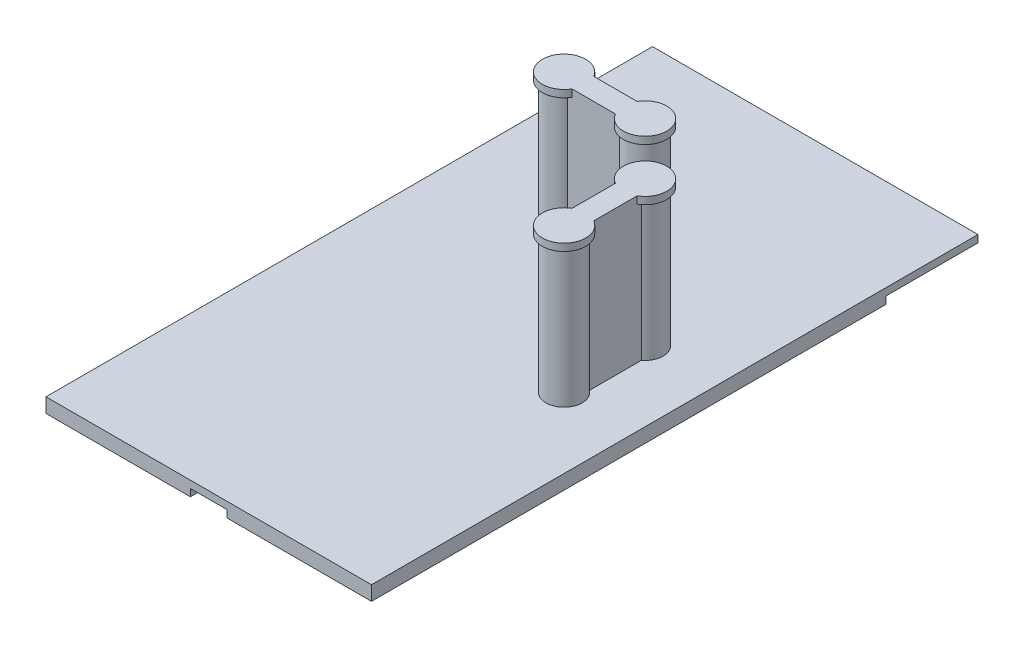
from build123d import *

# Parameters (mm, degrees)
SKETCH1_W           = 45
SKETCH1_H           = 83.86
BOSS_EXTRUDE1_DEPTH = 2
SKETCH3_W           = 45
SKETCH3_H           = 25.4
CUT_EXTRUDE1_DEPTH  = 1
SKETCH4_W           = 5.08
SKETCH4_H           = 25.4
CUT_EXTRUDE2_DEPTH  = 1
BOSS_EXTRUDE2_DEPTH = 20
BOSS_EXTRUDE3_START = -1
SKETCH6_R           = 3
BOSS_EXTRUDE3_DEPTH = 1


with BuildPart() as part:
    # Sketch1 → Boss-Extrude1 (new body)
    with BuildSketch(Plane(origin=(0, 0, 0), x_dir=(1, 0, 0), z_dir=(0, 1, 0))):
        Rectangle(SKETCH1_W, SKETCH1_H)
    extrude(amount=BOSS_EXTRUDE1_DEPTH)

    # Sketch3 → Cut-Extrude1 (cut)
    with BuildSketch(Plane.XZ):
        with Locations((0, -41.93)):
            Rectangle(SKETCH3_W, SKETCH3_H)
    extrude(amount=-CUT_EXTRUDE1_DEPTH, mode=Mode.SUBTRACT)

    # Sketch4 → Cut-Extrude2 (cut)
    with BuildSketch(Plane.XZ):
        with Locations((0, 29.23)):
            Rectangle(SKETCH4_W, SKETCH4_H)
    extrude(amount=-CUT_EXTRUDE2_DEPTH, mode=Mode.SUBTRACT)

    # Sketch5 → Boss-Extrude2 (add)
    with BuildSketch(Plane(origin=(0, 2, 0), x_dir=(1, 0, 0), z_dir=(0, 1, 0))):
        with BuildLine():
            Line((11.3, -3.6), (11.3, -5.6))
            Line((11.3, -5.6), (14.3, -5.6))
            Line((14.3, -5.6), (14.3, -3.6))
            ThreePointArc((14.3, -3.6), (12.8, -3.1), (11.3, -3.6))
        make_face()
        with BuildLine():
            Line((14.3, -5.6), (11.3, -5.6))
            Line((11.3, -5.6), (11.3, -3.6))
            ThreePointArc((11.3, -3.6), (11.681966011, -7.836067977), (15.3, -5.6))
            ThreePointArc((15.3, -5.6), (15.036067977, -4.481966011), (14.3, -3.6))
            Line((14.3, -3.6), (14.3, -5.6))
        make_face()
        with BuildLine():
            Line((11.3, -3.6), (11.3, -5.6))
            Line((11.3, -5.6), (14.3, -5.6))
            Line((14.3, -5.6), (14.3, -3.6))
            ThreePointArc((14.3, -3.6), (12.8, -3.1), (11.3, -3.6))
        make_face()
        with BuildLine():
            Line((14.3, -5.6), (11.3, -5.6))
            Line((11.3, -5.6), (11.3, -3.6))
            ThreePointArc((11.3, -3.6), (11.681966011, -7.836067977), (15.3, -5.6))
            ThreePointArc((15.3, -5.6), (15.036067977, -4.481966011), (14.3, -3.6))
            Line((14.3, -3.6), (14.3, -5.6))
        make_face()
        with BuildLine():
            Line((11.3, 3.6), (11.3, -3.6))
            ThreePointArc((11.3, -3.6), (12.8, -3.1), (14.3, -3.6))
            Line((14.3, -3.6), (14.3, 3.6))
            ThreePointArc((14.3, 3.6), (12.8, 3.1), (11.3, 3.6))
        make_face()
        with BuildLine():
            ThreePointArc((15.3, 5.6), (11.681966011, 7.836067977), (11.3, 3.6))
            Line((11.3, 3.6), (11.3, 5.6))
            Line((11.3, 5.6), (14.3, 5.6))
            Line((14.3, 5.6), (14.3, 3.6))
            ThreePointArc((14.3, 3.6), (15.036067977, 4.481966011), (15.3, 5.6))
        make_face()
        with BuildLine():
            Line((11.3, 5.6), (11.3, 3.6))
            ThreePointArc((11.3, 3.6), (12.8, 3.1), (14.3, 3.6))
            Line((14.3, 3.6), (14.3, 5.6))
            Line((14.3, 5.6), (11.3, 5.6))
        make_face()
        with BuildLine():
            ThreePointArc((15.3, 5.6), (11.681966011, 7.836067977), (11.3, 3.6))
            Line((11.3, 3.6), (11.3, 5.6))
            Line((11.3, 5.6), (14.3, 5.6))
            Line((14.3, 5.6), (14.3, 3.6))
            ThreePointArc((14.3, 3.6), (15.036067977, 4.481966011), (15.3, 5.6))
        make_face()
        with BuildLine():
            Line((11.3, 5.6), (11.3, 3.6))
            ThreePointArc((11.3, 3.6), (12.8, 3.1), (14.3, 3.6))
            Line((14.3, 3.6), (14.3, 5.6))
            Line((14.3, 5.6), (11.3, 5.6))
        make_face()
        with BuildLine():
            Line((-5.6, 11.3), (-5.6, 14.3))
            Line((-5.6, 14.3), (-3.6, 14.3))
            ThreePointArc((-3.6, 14.3), (-8.1, 12.8), (-3.6, 11.3))
            Line((-3.6, 11.3), (-5.6, 11.3))
        make_face()
        with BuildLine():
            Line((-3.6, 14.3), (-5.6, 14.3))
            Line((-5.6, 14.3), (-5.6, 11.3))
            Line((-5.6, 11.3), (-3.6, 11.3))
            ThreePointArc((-3.6, 11.3), (-3.228291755, 12.009430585), (-3.1, 12.8))
            ThreePointArc((-3.1, 12.8), (-3.228291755, 13.590569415), (-3.6, 14.3))
        make_face()
        with BuildLine():
            Line((-5.6, 11.3), (-5.6, 14.3))
            Line((-5.6, 14.3), (-3.6, 14.3))
            ThreePointArc((-3.6, 14.3), (-8.1, 12.8), (-3.6, 11.3))
            Line((-3.6, 11.3), (-5.6, 11.3))
        make_face()
        with BuildLine():
            Line((-3.6, 14.3), (-5.6, 14.3))
            Line((-5.6, 14.3), (-5.6, 11.3))
            Line((-5.6, 11.3), (-3.6, 11.3))
            ThreePointArc((-3.6, 11.3), (-3.228291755, 12.009430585), (-3.1, 12.8))
            ThreePointArc((-3.1, 12.8), (-3.228291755, 13.590569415), (-3.6, 14.3))
        make_face()
        with BuildLine():
            Line((3.6, 14.3), (-3.6, 14.3))
            ThreePointArc((-3.6, 14.3), (-3.228291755, 13.590569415), (-3.1, 12.8))
            ThreePointArc((-3.1, 12.8), (-3.228291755, 12.009430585), (-3.6, 11.3))
            Line((-3.6, 11.3), (3.6, 11.3))
            ThreePointArc((3.6, 11.3), (3.1, 12.8), (3.6, 14.3))
        make_face()
        with BuildLine():
            ThreePointArc((8.1, 12.8), (6.390569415, 15.171708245), (3.6, 14.3))
            Line((3.6, 14.3), (5.6, 14.3))
            Line((5.6, 14.3), (5.6, 11.3))
            Line((5.6, 11.3), (3.6, 11.3))
            ThreePointArc((3.6, 11.3), (6.390569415, 10.428291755), (8.1, 12.8))
        make_face()
        with BuildLine():
            Line((5.6, 14.3), (3.6, 14.3))
            ThreePointArc((3.6, 14.3), (3.1, 12.8), (3.6, 11.3))
            Line((3.6, 11.3), (5.6, 11.3))
            Line((5.6, 11.3), (5.6, 14.3))
        make_face()
        with BuildLine():
            ThreePointArc((8.1, 12.8), (6.390569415, 15.171708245), (3.6, 14.3))
            Line((3.6, 14.3), (5.6, 14.3))
            Line((5.6, 14.3), (5.6, 11.3))
            Line((5.6, 11.3), (3.6, 11.3))
            ThreePointArc((3.6, 11.3), (6.390569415, 10.428291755), (8.1, 12.8))
        make_face()
        with BuildLine():
            Line((5.6, 14.3), (3.6, 14.3))
            ThreePointArc((3.6, 14.3), (3.1, 12.8), (3.6, 11.3))
            Line((3.6, 11.3), (5.6, 11.3))
            Line((5.6, 11.3), (5.6, 14.3))
        make_face()
    extrude(amount=BOSS_EXTRUDE2_DEPTH)

    # Sketch6 → Boss-Extrude3 (add)
    with BuildSketch(Plane(origin=(0, 22, 0), x_dir=(1, 0, 0), z_dir=(0, 1, 0)).offset(BOSS_EXTRUDE3_START)):
        with BuildLine():
            Line((-3.6, 14.3), (-3.001923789, 14.3))
            ThreePointArc((-3.001923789, 14.3), (-8.6, 12.8), (-3.001923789, 11.3))
            Line((-3.001923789, 11.3), (-3.6, 11.3))
            ThreePointArc((-3.6, 11.3), (-8.1, 12.8), (-3.6, 14.3))
        make_face()
        with BuildLine():
            ThreePointArc((-2.6, 12.8), (-2.702222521, 13.576457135), (-3.001923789, 14.3))
            Line((-3.001923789, 14.3), (-3.6, 14.3))
            ThreePointArc((-3.6, 14.3), (-8.1, 12.8), (-3.6, 11.3))
            Line((-3.6, 11.3), (-3.001923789, 11.3))
            ThreePointArc((-3.001923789, 11.3), (-2.702222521, 12.023542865), (-2.6, 12.8))
        make_face()
        with BuildLine():
            Line((-3.6, 14.3), (-3.001923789, 14.3))
            ThreePointArc((-3.001923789, 14.3), (-8.6, 12.8), (-3.001923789, 11.3))
            Line((-3.001923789, 11.3), (-3.6, 11.3))
            ThreePointArc((-3.6, 11.3), (-8.1, 12.8), (-3.6, 14.3))
        make_face()
        with BuildLine():
            ThreePointArc((-2.6, 12.8), (-2.702222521, 13.576457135), (-3.001923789, 14.3))
            Line((-3.001923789, 14.3), (-3.6, 14.3))
            ThreePointArc((-3.6, 14.3), (-8.1, 12.8), (-3.6, 11.3))
            Line((-3.6, 11.3), (-3.001923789, 11.3))
            ThreePointArc((-3.001923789, 11.3), (-2.702222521, 12.023542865), (-2.6, 12.8))
        make_face()
        with BuildLine():
            Line((3.001923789, 14.3), (-3.001923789, 14.3))
            ThreePointArc((-3.001923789, 14.3), (-2.702222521, 13.576457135), (-2.6, 12.8))
            ThreePointArc((-2.6, 12.8), (-2.702222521, 12.023542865), (-3.001923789, 11.3))
            Line((-3.001923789, 11.3), (3.001923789, 11.3))
            ThreePointArc((3.001923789, 11.3), (2.6, 12.8), (3.001923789, 14.3))
        make_face()
        with BuildLine():
            Line((3.6, 14.3), (3.001923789, 14.3))
            ThreePointArc((3.001923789, 14.3), (2.6, 12.8), (3.001923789, 11.3))
            Line((3.001923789, 11.3), (3.6, 11.3))
            ThreePointArc((3.6, 11.3), (8.1, 12.8), (3.6, 14.3))
        make_face()
        with BuildLine():
            ThreePointArc((8.6, 12.8), (6.376457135, 15.697777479), (3.001923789, 14.3))
            Line((3.001923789, 14.3), (3.6, 14.3))
            ThreePointArc((3.6, 14.3), (8.1, 12.8), (3.6, 11.3))
            Line((3.6, 11.3), (3.001923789, 11.3))
            ThreePointArc((3.001923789, 11.3), (6.376457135, 9.902222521), (8.6, 12.8))
        make_face()
        with BuildLine():
            Line((3.6, 14.3), (3.001923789, 14.3))
            ThreePointArc((3.001923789, 14.3), (2.6, 12.8), (3.001923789, 11.3))
            Line((3.001923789, 11.3), (3.6, 11.3))
            ThreePointArc((3.6, 11.3), (8.1, 12.8), (3.6, 14.3))
        make_face()
        with BuildLine():
            ThreePointArc((8.6, 12.8), (6.376457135, 15.697777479), (3.001923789, 14.3))
            Line((3.001923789, 14.3), (3.6, 14.3))
            ThreePointArc((3.6, 14.3), (8.1, 12.8), (3.6, 11.3))
            Line((3.6, 11.3), (3.001923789, 11.3))
            ThreePointArc((3.001923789, 11.3), (6.376457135, 9.902222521), (8.6, 12.8))
        make_face()
        with Locations((12.8, 5.6)):
            Circle(SKETCH6_R)
        with BuildLine():
            ThreePointArc((14.3, 3.001923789), (12.8, 2.6), (11.3, 3.001923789))
            Line((11.3, 3.001923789), (11.3, -3.001923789))
            ThreePointArc((11.3, -3.001923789), (12.8, -2.6), (14.3, -3.001923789))
            Line((14.3, -3.001923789), (14.3, 3.001923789))
        make_face()
        with Locations((12.8, -5.6)):
            Circle(SKETCH6_R)
    extrude(amount=BOSS_EXTRUDE3_DEPTH)


solid = part.part
